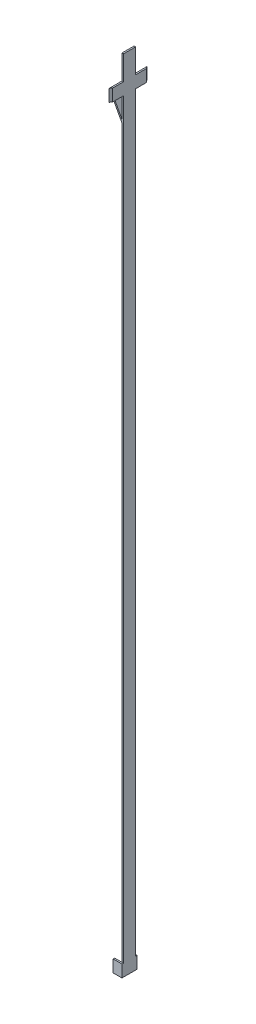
ISO-10303-21;
HEADER;
FILE_DESCRIPTION(('STEP AP214'),'2;1');
FILE_NAME('part.step','',(''),(''),'','','');
FILE_SCHEMA(('AUTOMOTIVE_DESIGN { 1 0 10303 214 1 1 1 1 }'));
ENDSEC;
DATA;
#1=APPLICATION_CONTEXT('core data for automotive mechanical design processes');
#2=APPLICATION_PROTOCOL_DEFINITION('international standard','automotive_design',2000,#1);
#3=PRODUCT_CONTEXT('',#1,'mechanical');
#4=PRODUCT('Part','Part','',(#3));
#5=PRODUCT_RELATED_PRODUCT_CATEGORY('part','',(#4));
#6=PRODUCT_DEFINITION_FORMATION('','',#4);
#7=PRODUCT_DEFINITION_CONTEXT('part definition',#1,'design');
#8=PRODUCT_DEFINITION('design','',#6,#7);
#9=PRODUCT_DEFINITION_SHAPE('','',#8);
#10=(LENGTH_UNIT() NAMED_UNIT(*) SI_UNIT(.MILLI.,.METRE.));
#11=(NAMED_UNIT(*) PLANE_ANGLE_UNIT() SI_UNIT($,.RADIAN.));
#12=(NAMED_UNIT(*) SI_UNIT($,.STERADIAN.) SOLID_ANGLE_UNIT());
#13=UNCERTAINTY_MEASURE_WITH_UNIT(LENGTH_MEASURE(1.E-05),#10,'distance_accuracy_value','');
#14=(GEOMETRIC_REPRESENTATION_CONTEXT(3) GLOBAL_UNCERTAINTY_ASSIGNED_CONTEXT((#13)) GLOBAL_UNIT_ASSIGNED_CONTEXT((#10,
#11,#12)) REPRESENTATION_CONTEXT('',''));
#15=CARTESIAN_POINT('',(0.,0.,0.));
#16=DIRECTION('',(0.,0.,1.));
#17=DIRECTION('',(1.,0.,0.));
#18=AXIS2_PLACEMENT_3D('',#15,#16,#17);
#19=CARTESIAN_POINT('',(0.,-9.99999999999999,10.61));
#20=DIRECTION('',(0.,-1.,0.));
#21=DIRECTION('',(0.,0.,-1.));
#22=AXIS2_PLACEMENT_3D('',#19,#20,#21);
#23=PLANE('',#22);
#24=CARTESIAN_POINT('',(-9.17,-10.,0.));
#25=DIRECTION('',(0.,-1.,0.));
#26=DIRECTION('',(0.,0.,-1.));
#27=AXIS2_PLACEMENT_3D('',#24,#25,#26);
#28=CIRCLE('',#27,12.);
#29=CARTESIAN_POINT('',(0.,-10.,-7.74022609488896));
#30=VERTEX_POINT('',#29);
#31=CARTESIAN_POINT('',(0.609999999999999,-10.,-6.95353147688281));
#32=VERTEX_POINT('',#31);
#33=EDGE_CURVE('E65',#30,#32,#28,.T.);
#34=ORIENTED_EDGE('',*,*,#33,.F.);
#35=DIRECTION('',(0.,0.,-1.));
#36=VECTOR('',#35,1.);
#37=CARTESIAN_POINT('',(0.,-9.99999999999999,10.61));
#38=LINE('',#37,#36);
#39=CARTESIAN_POINT('',(0.,-9.99999999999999,-2.5));
#40=VERTEX_POINT('',#39);
#41=EDGE_CURVE('E216',#40,#30,#38,.T.);
#42=ORIENTED_EDGE('',*,*,#41,.F.);
#43=DIRECTION('',(1.,0.,0.));
#44=VECTOR('',#43,1.);
#45=CARTESIAN_POINT('',(0.,-9.99999999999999,-2.5));
#46=LINE('',#45,#44);
#47=CARTESIAN_POINT('',(0.61,-9.99999999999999,-2.5));
#48=VERTEX_POINT('',#47);
#49=EDGE_CURVE('E379',#40,#48,#46,.T.);
#50=ORIENTED_EDGE('',*,*,#49,.T.);
#51=DIRECTION('',(0.,0.,-1.));
#52=VECTOR('',#51,1.);
#53=CARTESIAN_POINT('',(0.61,-9.99999999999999,10.61));
#54=LINE('',#53,#52);
#55=EDGE_CURVE('E215',#48,#32,#54,.T.);
#56=ORIENTED_EDGE('',*,*,#55,.T.);
#57=EDGE_LOOP('',(#34,#42,#50,#56));
#58=FACE_BOUND('',#57,.T.);
#59=ADVANCED_FACE('F43',(#58),#23,.F.);
#60=CARTESIAN_POINT('',(0.,-15.,10.61));
#61=DIRECTION('',(0.,1.,0.));
#62=DIRECTION('',(0.,0.,1.));
#63=AXIS2_PLACEMENT_3D('',#60,#61,#62);
#64=PLANE('',#63);
#65=CARTESIAN_POINT('',(-9.17,-15.,0.));
#66=DIRECTION('',(0.,1.,0.));
#67=DIRECTION('',(0.,0.,1.));
#68=AXIS2_PLACEMENT_3D('',#65,#66,#67);
#69=CIRCLE('',#68,12.);
#70=CARTESIAN_POINT('',(0.609999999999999,-15.,-6.95353147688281));
#71=VERTEX_POINT('',#70);
#72=CARTESIAN_POINT('',(0.,-15.,-7.74022609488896));
#73=VERTEX_POINT('',#72);
#74=EDGE_CURVE('E236',#71,#73,#69,.T.);
#75=ORIENTED_EDGE('',*,*,#74,.F.);
#76=DIRECTION('',(0.,0.,-1.));
#77=VECTOR('',#76,1.);
#78=CARTESIAN_POINT('',(0.61,-15.,10.61));
#79=LINE('',#78,#77);
#80=CARTESIAN_POINT('',(0.610000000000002,-15.,-2.5));
#81=VERTEX_POINT('',#80);
#82=EDGE_CURVE('E246',#81,#71,#79,.T.);
#83=ORIENTED_EDGE('',*,*,#82,.F.);
#84=DIRECTION('',(-1.,0.,0.));
#85=VECTOR('',#84,1.);
#86=CARTESIAN_POINT('',(0.,-15.,-2.5));
#87=LINE('',#86,#85);
#88=CARTESIAN_POINT('',(0.,-15.,-2.5));
#89=VERTEX_POINT('',#88);
#90=EDGE_CURVE('E51',#81,#89,#87,.T.);
#91=ORIENTED_EDGE('',*,*,#90,.T.);
#92=DIRECTION('',(0.,0.,-1.));
#93=VECTOR('',#92,1.);
#94=CARTESIAN_POINT('',(0.,-15.,10.61));
#95=LINE('',#94,#93);
#96=EDGE_CURVE('E249',#89,#73,#95,.T.);
#97=ORIENTED_EDGE('',*,*,#96,.T.);
#98=EDGE_LOOP('',(#75,#83,#91,#97));
#99=FACE_BOUND('',#98,.T.);
#100=ADVANCED_FACE('F389',(#99),#64,.F.);
#101=CARTESIAN_POINT('',(-9.17,-15.,0.));
#102=DIRECTION('',(0.,1.,0.));
#103=DIRECTION('',(0.,0.,1.));
#104=AXIS2_PLACEMENT_3D('',#101,#102,#103);
#105=CIRCLE('',#104,12.);
#106=CARTESIAN_POINT('',(0.,-15.,7.74022609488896));
#107=VERTEX_POINT('',#106);
#108=CARTESIAN_POINT('',(0.609999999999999,-15.,6.95353147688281));
#109=VERTEX_POINT('',#108);
#110=EDGE_CURVE('E227',#107,#109,#105,.T.);
#111=ORIENTED_EDGE('',*,*,#110,.F.);
#112=CARTESIAN_POINT('',(0.,-15.,2.5));
#113=VERTEX_POINT('',#112);
#114=EDGE_CURVE('E224',#107,#113,#95,.T.);
#115=ORIENTED_EDGE('',*,*,#114,.T.);
#116=DIRECTION('',(-1.,0.,0.));
#117=VECTOR('',#116,1.);
#118=CARTESIAN_POINT('',(0.,-15.,2.5));
#119=LINE('',#118,#117);
#120=CARTESIAN_POINT('',(0.61,-15.,2.5));
#121=VERTEX_POINT('',#120);
#122=EDGE_CURVE('E252',#121,#113,#119,.T.);
#123=ORIENTED_EDGE('',*,*,#122,.F.);
#124=EDGE_CURVE('E247',#109,#121,#79,.T.);
#125=ORIENTED_EDGE('',*,*,#124,.F.);
#126=EDGE_LOOP('',(#111,#115,#123,#125));
#127=FACE_BOUND('',#126,.T.);
#128=ADVANCED_FACE('F468',(#127),#64,.F.);
#129=CARTESIAN_POINT('',(-9.17,-10.,0.));
#130=DIRECTION('',(0.,-1.,0.));
#131=DIRECTION('',(0.,0.,-1.));
#132=AXIS2_PLACEMENT_3D('',#129,#130,#131);
#133=CIRCLE('',#132,12.);
#134=CARTESIAN_POINT('',(0.609999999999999,-10.,6.95353147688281));
#135=VERTEX_POINT('',#134);
#136=CARTESIAN_POINT('',(0.,-10.,7.74022609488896));
#137=VERTEX_POINT('',#136);
#138=EDGE_CURVE('E11',#135,#137,#133,.T.);
#139=ORIENTED_EDGE('',*,*,#138,.F.);
#140=CARTESIAN_POINT('',(0.610000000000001,-9.99999999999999,2.5));
#141=VERTEX_POINT('',#140);
#142=EDGE_CURVE('E244',#135,#141,#54,.T.);
#143=ORIENTED_EDGE('',*,*,#142,.T.);
#144=DIRECTION('',(1.,0.,0.));
#145=VECTOR('',#144,1.);
#146=CARTESIAN_POINT('',(0.,-9.99999999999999,2.5));
#147=LINE('',#146,#145);
#148=CARTESIAN_POINT('',(0.,-9.99999999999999,2.5));
#149=VERTEX_POINT('',#148);
#150=EDGE_CURVE('E211',#149,#141,#147,.T.);
#151=ORIENTED_EDGE('',*,*,#150,.F.);
#152=EDGE_CURVE('E206',#137,#149,#38,.T.);
#153=ORIENTED_EDGE('',*,*,#152,.F.);
#154=EDGE_LOOP('',(#139,#143,#151,#153));
#155=FACE_BOUND('',#154,.T.);
#156=ADVANCED_FACE('F208',(#155),#23,.F.);
#157=CARTESIAN_POINT('',(0.,0.,2.5));
#158=DIRECTION('',(0.,0.,1.));
#159=DIRECTION('',(1.,0.,0.));
#160=AXIS2_PLACEMENT_3D('',#157,#158,#159);
#161=PLANE('',#160);
#162=DIRECTION('',(-0.984807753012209,-0.173648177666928,0.));
#163=VECTOR('',#162,1.);
#164=CARTESIAN_POINT('',(2.6710764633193,-15.1484273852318,2.5));
#165=LINE('',#164,#163);
#166=CARTESIAN_POINT('',(0.,-15.6194102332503,2.5));
#167=VERTEX_POINT('',#166);
#168=CARTESIAN_POINT('',(-3.98617976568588,-16.3222812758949,2.5));
#169=VERTEX_POINT('',#168);
#170=EDGE_CURVE('E317',#167,#169,#165,.T.);
#171=ORIENTED_EDGE('',*,*,#170,.F.);
#172=DIRECTION('',(0.,-1.,0.));
#173=VECTOR('',#172,1.);
#174=CARTESIAN_POINT('',(0.,0.,2.5));
#175=LINE('',#174,#173);
#176=CARTESIAN_POINT('',(0.,-23.7147562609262,2.5));
#177=VERTEX_POINT('',#176);
#178=EDGE_CURVE('E320',#167,#177,#175,.T.);
#179=ORIENTED_EDGE('',*,*,#178,.T.);
#180=DIRECTION('',(0.474618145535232,-0.880191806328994,0.));
#181=VECTOR('',#180,1.);
#182=CARTESIAN_POINT('',(-9.90695806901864,-5.34204253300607,2.5));
#183=LINE('',#182,#181);
#184=EDGE_CURVE('E323',#169,#177,#183,.T.);
#185=ORIENTED_EDGE('',*,*,#184,.F.);
#186=EDGE_LOOP('',(#171,#179,#185));
#187=FACE_BOUND('',#186,.T.);
#188=DIRECTION('',(0.,-1.,0.));
#189=VECTOR('',#188,1.);
#190=CARTESIAN_POINT('',(0.61,0.,2.5));
#191=LINE('',#190,#189);
#192=CARTESIAN_POINT('',(0.61000000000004,-325.,2.5));
#193=VERTEX_POINT('',#192);
#194=EDGE_CURVE('E335',#121,#193,#191,.T.);
#195=ORIENTED_EDGE('',*,*,#194,.F.);
#196=ORIENTED_EDGE('',*,*,#122,.T.);
#197=DIRECTION('',(-0.984807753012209,-0.173648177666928,0.));
#198=VECTOR('',#197,1.);
#199=CARTESIAN_POINT('',(2.56515107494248,-14.5476946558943,2.5));
#200=LINE('',#199,#198);
#201=CARTESIAN_POINT('',(-4.92403876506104,-15.8682408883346,2.5));
#202=VERTEX_POINT('',#201);
#203=EDGE_CURVE('E328',#113,#202,#200,.T.);
#204=ORIENTED_EDGE('',*,*,#203,.T.);
#205=DIRECTION('',(0.474618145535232,-0.880191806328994,0.));
#206=VECTOR('',#205,1.);
#207=CARTESIAN_POINT('',(-10.4438750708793,-5.63155960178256,2.5));
#208=LINE('',#207,#206);
#209=CARTESIAN_POINT('',(0.,-25.,2.5));
#210=VERTEX_POINT('',#209);
#211=EDGE_CURVE('E330',#202,#210,#208,.T.);
#212=ORIENTED_EDGE('',*,*,#211,.T.);
#213=CARTESIAN_POINT('',(0.,-325.,2.5));
#214=VERTEX_POINT('',#213);
#215=EDGE_CURVE('E324',#210,#214,#175,.T.);
#216=ORIENTED_EDGE('',*,*,#215,.T.);
#217=DIRECTION('',(1.,0.,0.));
#218=VECTOR('',#217,1.);
#219=CARTESIAN_POINT('',(0.,-325.,2.5));
#220=LINE('',#219,#218);
#221=EDGE_CURVE('E332',#214,#193,#220,.T.);
#222=ORIENTED_EDGE('',*,*,#221,.T.);
#223=EDGE_LOOP('',(#195,#196,#204,#212,#216,#222));
#224=FACE_BOUND('',#223,.T.);
#225=ADVANCED_FACE('F438',(#187,#224),#161,.T.);
#226=CARTESIAN_POINT('',(0.,0.,2.5));
#227=VERTEX_POINT('',#226);
#228=EDGE_CURVE('E325',#227,#149,#175,.T.);
#229=ORIENTED_EDGE('',*,*,#228,.T.);
#230=ORIENTED_EDGE('',*,*,#150,.T.);
#231=CARTESIAN_POINT('',(0.61,0.,2.5));
#232=VERTEX_POINT('',#231);
#233=EDGE_CURVE('E336',#232,#141,#191,.T.);
#234=ORIENTED_EDGE('',*,*,#233,.F.);
#235=DIRECTION('',(1.,0.,0.));
#236=VECTOR('',#235,1.);
#237=CARTESIAN_POINT('',(0.,0.,2.5));
#238=LINE('',#237,#236);
#239=EDGE_CURVE('E339',#227,#232,#238,.T.);
#240=ORIENTED_EDGE('',*,*,#239,.F.);
#241=EDGE_LOOP('',(#229,#230,#234,#240));
#242=FACE_BOUND('',#241,.T.);
#243=ADVANCED_FACE('F433',(#242),#161,.T.);
#244=CARTESIAN_POINT('',(0.,0.,-2.5));
#245=DIRECTION('',(0.,0.,1.));
#246=DIRECTION('',(1.,0.,0.));
#247=AXIS2_PLACEMENT_3D('',#244,#245,#246);
#248=PLANE('',#247);
#249=DIRECTION('',(-0.984807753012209,-0.173648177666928,0.));
#250=VECTOR('',#249,1.);
#251=CARTESIAN_POINT('',(2.6710764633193,-15.1484273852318,-2.5));
#252=LINE('',#251,#250);
#253=CARTESIAN_POINT('',(0.,-15.6194102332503,-2.5));
#254=VERTEX_POINT('',#253);
#255=CARTESIAN_POINT('',(-3.98617976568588,-16.3222812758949,-2.5));
#256=VERTEX_POINT('',#255);
#257=EDGE_CURVE('E316',#254,#256,#252,.T.);
#258=ORIENTED_EDGE('',*,*,#257,.T.);
#259=DIRECTION('',(0.474618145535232,-0.880191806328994,0.));
#260=VECTOR('',#259,1.);
#261=CARTESIAN_POINT('',(-9.90695806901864,-5.34204253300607,-2.5));
#262=LINE('',#261,#260);
#263=CARTESIAN_POINT('',(0.,-23.7147562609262,-2.5));
#264=VERTEX_POINT('',#263);
#265=EDGE_CURVE('E348',#256,#264,#262,.T.);
#266=ORIENTED_EDGE('',*,*,#265,.T.);
#267=DIRECTION('',(0.,-1.,0.));
#268=VECTOR('',#267,1.);
#269=CARTESIAN_POINT('',(0.,0.,-2.5));
#270=LINE('',#269,#268);
#271=EDGE_CURVE('E345',#254,#264,#270,.T.);
#272=ORIENTED_EDGE('',*,*,#271,.F.);
#273=EDGE_LOOP('',(#258,#266,#272));
#274=FACE_BOUND('',#273,.T.);
#275=ORIENTED_EDGE('',*,*,#90,.F.);
#276=DIRECTION('',(0.,-1.,0.));
#277=VECTOR('',#276,1.);
#278=CARTESIAN_POINT('',(0.61,0.,-2.5));
#279=LINE('',#278,#277);
#280=CARTESIAN_POINT('',(0.61000000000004,-325.,-2.5));
#281=VERTEX_POINT('',#280);
#282=EDGE_CURVE('E360',#81,#281,#279,.T.);
#283=ORIENTED_EDGE('',*,*,#282,.T.);
#284=DIRECTION('',(1.,0.,0.));
#285=VECTOR('',#284,1.);
#286=CARTESIAN_POINT('',(0.,-325.,-2.5));
#287=LINE('',#286,#285);
#288=CARTESIAN_POINT('',(0.,-325.,-2.5));
#289=VERTEX_POINT('',#288);
#290=EDGE_CURVE('E357',#289,#281,#287,.T.);
#291=ORIENTED_EDGE('',*,*,#290,.F.);
#292=CARTESIAN_POINT('',(0.,-25.,-2.5));
#293=VERTEX_POINT('',#292);
#294=EDGE_CURVE('E349',#293,#289,#270,.T.);
#295=ORIENTED_EDGE('',*,*,#294,.F.);
#296=DIRECTION('',(0.474618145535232,-0.880191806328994,0.));
#297=VECTOR('',#296,1.);
#298=CARTESIAN_POINT('',(-10.4438750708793,-5.63155960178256,-2.5));
#299=LINE('',#298,#297);
#300=CARTESIAN_POINT('',(-4.92403876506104,-15.8682408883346,-2.5));
#301=VERTEX_POINT('',#300);
#302=EDGE_CURVE('E355',#301,#293,#299,.T.);
#303=ORIENTED_EDGE('',*,*,#302,.F.);
#304=DIRECTION('',(-0.984807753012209,-0.173648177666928,0.));
#305=VECTOR('',#304,1.);
#306=CARTESIAN_POINT('',(2.56515107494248,-14.5476946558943,-2.5));
#307=LINE('',#306,#305);
#308=EDGE_CURVE('E353',#89,#301,#307,.T.);
#309=ORIENTED_EDGE('',*,*,#308,.F.);
#310=EDGE_LOOP('',(#275,#283,#291,#295,#303,#309));
#311=FACE_BOUND('',#310,.T.);
#312=ADVANCED_FACE('F399',(#274,#311),#248,.F.);
#313=ORIENTED_EDGE('',*,*,#49,.F.);
#314=CARTESIAN_POINT('',(0.,0.,-2.5));
#315=VERTEX_POINT('',#314);
#316=EDGE_CURVE('E350',#315,#40,#270,.T.);
#317=ORIENTED_EDGE('',*,*,#316,.F.);
#318=DIRECTION('',(1.,0.,0.));
#319=VECTOR('',#318,1.);
#320=CARTESIAN_POINT('',(0.,0.,-2.5));
#321=LINE('',#320,#319);
#322=CARTESIAN_POINT('',(0.61,0.,-2.5));
#323=VERTEX_POINT('',#322);
#324=EDGE_CURVE('E321',#315,#323,#321,.T.);
#325=ORIENTED_EDGE('',*,*,#324,.T.);
#326=EDGE_CURVE('E361',#323,#48,#279,.T.);
#327=ORIENTED_EDGE('',*,*,#326,.T.);
#328=EDGE_LOOP('',(#313,#317,#325,#327));
#329=FACE_BOUND('',#328,.T.);
#330=ADVANCED_FACE('F428',(#329),#248,.F.);
#331=CARTESIAN_POINT('',(0.,-325.,3.11));
#332=DIRECTION('',(0.,1.,0.));
#333=DIRECTION('',(0.,0.,1.));
#334=AXIS2_PLACEMENT_3D('',#331,#332,#333);
#335=PLANE('',#334);
#336=DIRECTION('',(1.,0.,0.));
#337=VECTOR('',#336,1.);
#338=CARTESIAN_POINT('',(0.,-325.,2.5));
#339=LINE('',#338,#337);
#340=CARTESIAN_POINT('',(-2.99999999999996,-325.,2.5));
#341=VERTEX_POINT('',#340);
#342=EDGE_CURVE('E263',#341,#214,#339,.T.);
#343=ORIENTED_EDGE('',*,*,#342,.F.);
#344=DIRECTION('',(0.,0.,-1.));
#345=VECTOR('',#344,1.);
#346=CARTESIAN_POINT('',(-2.99999999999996,-325.,3.11));
#347=LINE('',#346,#345);
#348=CARTESIAN_POINT('',(-2.99999999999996,-325.,3.11));
#349=VERTEX_POINT('',#348);
#350=EDGE_CURVE('E313',#349,#341,#347,.T.);
#351=ORIENTED_EDGE('',*,*,#350,.F.);
#352=DIRECTION('',(1.,0.,0.));
#353=VECTOR('',#352,1.);
#354=CARTESIAN_POINT('',(0.,-325.,3.11));
#355=LINE('',#354,#353);
#356=CARTESIAN_POINT('',(0.61000000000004,-325.,3.11));
#357=VERTEX_POINT('',#356);
#358=EDGE_CURVE('E279',#349,#357,#355,.T.);
#359=ORIENTED_EDGE('',*,*,#358,.T.);
#360=DIRECTION('',(0.,0.,-1.));
#361=VECTOR('',#360,1.);
#362=CARTESIAN_POINT('',(0.61000000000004,-325.,3.11));
#363=LINE('',#362,#361);
#364=EDGE_CURVE('E303',#357,#193,#363,.T.);
#365=ORIENTED_EDGE('',*,*,#364,.T.);
#366=ORIENTED_EDGE('',*,*,#221,.F.);
#367=EDGE_LOOP('',(#343,#351,#359,#365,#366));
#368=FACE_BOUND('',#367,.T.);
#369=ADVANCED_FACE('F442',(#368),#335,.T.);
#370=CARTESIAN_POINT('',(-2.99999999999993,0.,3.11));
#371=DIRECTION('',(-1.,0.,0.));
#372=DIRECTION('',(0.,-1.,0.));
#373=AXIS2_PLACEMENT_3D('',#370,#371,#372);
#374=PLANE('',#373);
#375=DIRECTION('',(0.,1.,0.));
#376=VECTOR('',#375,1.);
#377=CARTESIAN_POINT('',(-2.99999999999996,-330.001,2.5));
#378=LINE('',#377,#376);
#379=CARTESIAN_POINT('',(-2.99999999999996,-330.,2.5));
#380=VERTEX_POINT('',#379);
#381=EDGE_CURVE('E270',#380,#341,#378,.T.);
#382=ORIENTED_EDGE('',*,*,#381,.F.);
#383=DIRECTION('',(0.,0.,-1.));
#384=VECTOR('',#383,1.);
#385=CARTESIAN_POINT('',(-2.99999999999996,-330.,3.11));
#386=LINE('',#385,#384);
#387=CARTESIAN_POINT('',(-2.99999999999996,-330.,3.11));
#388=VERTEX_POINT('',#387);
#389=EDGE_CURVE('E309',#388,#380,#386,.T.);
#390=ORIENTED_EDGE('',*,*,#389,.F.);
#391=DIRECTION('',(0.,1.,0.));
#392=VECTOR('',#391,1.);
#393=CARTESIAN_POINT('',(-2.99999999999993,0.,3.11));
#394=LINE('',#393,#392);
#395=EDGE_CURVE('E282',#388,#349,#394,.T.);
#396=ORIENTED_EDGE('',*,*,#395,.T.);
#397=ORIENTED_EDGE('',*,*,#350,.T.);
#398=EDGE_LOOP('',(#382,#390,#396,#397));
#399=FACE_BOUND('',#398,.T.);
#400=ADVANCED_FACE('F500',(#399),#374,.T.);
#401=CARTESIAN_POINT('',(0.,0.,2.5));
#402=DIRECTION('',(1.,0.,0.));
#403=DIRECTION('',(0.,1.,0.));
#404=AXIS2_PLACEMENT_3D('',#401,#402,#403);
#405=PLANE('',#404);
#406=DIRECTION('',(0.,1.,0.));
#407=VECTOR('',#406,1.);
#408=CARTESIAN_POINT('',(0.,-330.,-7.74022609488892));
#409=LINE('',#408,#407);
#410=EDGE_CURVE('E240',#73,#30,#409,.T.);
#411=ORIENTED_EDGE('',*,*,#410,.F.);
#412=ORIENTED_EDGE('',*,*,#96,.F.);
#413=DIRECTION('',(0.,0.,-1.));
#414=VECTOR('',#413,1.);
#415=CARTESIAN_POINT('',(0.,-15.,2.5));
#416=LINE('',#415,#414);
#417=EDGE_CURVE('E376',#113,#89,#416,.T.);
#418=ORIENTED_EDGE('',*,*,#417,.F.);
#419=ORIENTED_EDGE('',*,*,#114,.F.);
#420=DIRECTION('',(0.,1.,0.));
#421=VECTOR('',#420,1.);
#422=CARTESIAN_POINT('',(0.,-330.,7.74022609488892));
#423=LINE('',#422,#421);
#424=EDGE_CURVE('E220',#137,#107,#423,.F.);
#425=ORIENTED_EDGE('',*,*,#424,.F.);
#426=ORIENTED_EDGE('',*,*,#152,.T.);
#427=ORIENTED_EDGE('',*,*,#228,.F.);
#428=DIRECTION('',(0.,0.,-1.));
#429=VECTOR('',#428,1.);
#430=CARTESIAN_POINT('',(0.,0.,2.5));
#431=LINE('',#430,#429);
#432=EDGE_CURVE('E365',#227,#315,#431,.T.);
#433=ORIENTED_EDGE('',*,*,#432,.T.);
#434=ORIENTED_EDGE('',*,*,#316,.T.);
#435=ORIENTED_EDGE('',*,*,#41,.T.);
#436=EDGE_LOOP('',(#411,#412,#418,#419,#425,#426,#427,#433,#434,#435));
#437=FACE_BOUND('',#436,.T.);
#438=ADVANCED_FACE('F222',(#437),#405,.F.);
#439=CARTESIAN_POINT('',(2.56515107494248,-14.5476946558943,2.5));
#440=DIRECTION('',(0.173648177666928,-0.984807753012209,0.));
#441=DIRECTION('',(0.984807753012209,0.173648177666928,0.));
#442=AXIS2_PLACEMENT_3D('',#439,#440,#441);
#443=PLANE('',#442);
#444=ORIENTED_EDGE('',*,*,#308,.T.);
#445=DIRECTION('',(0.,0.,-1.));
#446=VECTOR('',#445,1.);
#447=CARTESIAN_POINT('',(-4.92403876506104,-15.8682408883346,2.5));
#448=LINE('',#447,#446);
#449=EDGE_CURVE('E373',#202,#301,#448,.T.);
#450=ORIENTED_EDGE('',*,*,#449,.F.);
#451=ORIENTED_EDGE('',*,*,#203,.F.);
#452=ORIENTED_EDGE('',*,*,#417,.T.);
#453=EDGE_LOOP('',(#444,#450,#451,#452));
#454=FACE_BOUND('',#453,.T.);
#455=ADVANCED_FACE('F450',(#454),#443,.F.);
#456=CARTESIAN_POINT('',(-10.4438750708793,-5.63155960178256,2.5));
#457=DIRECTION('',(0.880191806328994,0.474618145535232,0.));
#458=DIRECTION('',(-0.474618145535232,0.880191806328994,0.));
#459=AXIS2_PLACEMENT_3D('',#456,#457,#458);
#460=PLANE('',#459);
#461=ORIENTED_EDGE('',*,*,#302,.T.);
#462=DIRECTION('',(0.,0.,-1.));
#463=VECTOR('',#462,1.);
#464=CARTESIAN_POINT('',(0.,-25.,2.5));
#465=LINE('',#464,#463);
#466=EDGE_CURVE('E370',#210,#293,#465,.T.);
#467=ORIENTED_EDGE('',*,*,#466,.F.);
#468=ORIENTED_EDGE('',*,*,#211,.F.);
#469=ORIENTED_EDGE('',*,*,#449,.T.);
#470=EDGE_LOOP('',(#461,#467,#468,#469));
#471=FACE_BOUND('',#470,.T.);
#472=ADVANCED_FACE('F452',(#471),#460,.F.);
#473=ORIENTED_EDGE('',*,*,#294,.T.);
#474=DIRECTION('',(0.,1.,0.));
#475=VECTOR('',#474,1.);
#476=CARTESIAN_POINT('',(0.,-330.001,-2.5));
#477=LINE('',#476,#475);
#478=CARTESIAN_POINT('',(0.,-330.,-2.5));
#479=VERTEX_POINT('',#478);
#480=EDGE_CURVE('E266',#479,#289,#477,.T.);
#481=ORIENTED_EDGE('',*,*,#480,.F.);
#482=DIRECTION('',(0.,0.,-1.));
#483=VECTOR('',#482,1.);
#484=CARTESIAN_POINT('',(0.,-330.,-2.5));
#485=LINE('',#484,#483);
#486=CARTESIAN_POINT('',(0.,-330.,2.5));
#487=VERTEX_POINT('',#486);
#488=EDGE_CURVE('E255',#487,#479,#485,.T.);
#489=ORIENTED_EDGE('',*,*,#488,.F.);
#490=DIRECTION('',(0.,1.,0.));
#491=VECTOR('',#490,1.);
#492=CARTESIAN_POINT('',(0.,-330.001,2.5));
#493=LINE('',#492,#491);
#494=EDGE_CURVE('E267',#487,#214,#493,.T.);
#495=ORIENTED_EDGE('',*,*,#494,.T.);
#496=ORIENTED_EDGE('',*,*,#215,.F.);
#497=ORIENTED_EDGE('',*,*,#466,.T.);
#498=EDGE_LOOP('',(#473,#481,#489,#495,#496,#497));
#499=FACE_BOUND('',#498,.T.);
#500=ADVANCED_FACE('F418',(#499),#405,.F.);
#501=CARTESIAN_POINT('',(0.61,0.,2.5));
#502=DIRECTION('',(1.,0.,0.));
#503=DIRECTION('',(0.,1.,0.));
#504=AXIS2_PLACEMENT_3D('',#501,#502,#503);
#505=PLANE('',#504);
#506=ORIENTED_EDGE('',*,*,#82,.T.);
#507=DIRECTION('',(0.,1.,0.));
#508=VECTOR('',#507,1.);
#509=CARTESIAN_POINT('',(0.610000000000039,-330.,-6.95353147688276));
#510=LINE('',#509,#508);
#511=EDGE_CURVE('E58',#71,#32,#510,.T.);
#512=ORIENTED_EDGE('',*,*,#511,.T.);
#513=ORIENTED_EDGE('',*,*,#55,.F.);
#514=ORIENTED_EDGE('',*,*,#326,.F.);
#515=DIRECTION('',(0.,0.,-1.));
#516=VECTOR('',#515,1.);
#517=CARTESIAN_POINT('',(0.61,0.,2.5));
#518=LINE('',#517,#516);
#519=EDGE_CURVE('E367',#232,#323,#518,.T.);
#520=ORIENTED_EDGE('',*,*,#519,.F.);
#521=ORIENTED_EDGE('',*,*,#233,.T.);
#522=ORIENTED_EDGE('',*,*,#142,.F.);
#523=DIRECTION('',(0.,1.,0.));
#524=VECTOR('',#523,1.);
#525=CARTESIAN_POINT('',(0.610000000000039,-330.,6.95353147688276));
#526=LINE('',#525,#524);
#527=EDGE_CURVE('E228',#135,#109,#526,.F.);
#528=ORIENTED_EDGE('',*,*,#527,.T.);
#529=ORIENTED_EDGE('',*,*,#124,.T.);
#530=ORIENTED_EDGE('',*,*,#194,.T.);
#531=ORIENTED_EDGE('',*,*,#364,.F.);
#532=DIRECTION('',(0.,-1.,0.));
#533=VECTOR('',#532,1.);
#534=CARTESIAN_POINT('',(0.61,0.,3.11));
#535=LINE('',#534,#533);
#536=CARTESIAN_POINT('',(0.61000000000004,-330.,3.11));
#537=VERTEX_POINT('',#536);
#538=EDGE_CURVE('E289',#357,#537,#535,.T.);
#539=ORIENTED_EDGE('',*,*,#538,.T.);
#540=DIRECTION('',(0.,0.,-1.));
#541=VECTOR('',#540,1.);
#542=CARTESIAN_POINT('',(0.61000000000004,-330.,3.11));
#543=LINE('',#542,#541);
#544=CARTESIAN_POINT('',(0.61000000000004,-330.,-3.11));
#545=VERTEX_POINT('',#544);
#546=EDGE_CURVE('E306',#537,#545,#543,.T.);
#547=ORIENTED_EDGE('',*,*,#546,.T.);
#548=DIRECTION('',(0.,-1.,0.));
#549=VECTOR('',#548,1.);
#550=CARTESIAN_POINT('',(0.61,0.,-3.11));
#551=LINE('',#550,#549);
#552=CARTESIAN_POINT('',(0.61000000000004,-325.,-3.11));
#553=VERTEX_POINT('',#552);
#554=EDGE_CURVE('E283',#553,#545,#551,.T.);
#555=ORIENTED_EDGE('',*,*,#554,.F.);
#556=EDGE_CURVE('E292',#281,#553,#363,.T.);
#557=ORIENTED_EDGE('',*,*,#556,.F.);
#558=ORIENTED_EDGE('',*,*,#282,.F.);
#559=EDGE_LOOP('',(#506,#512,#513,#514,#520,#521,#522,#528,#529,#530,#531,#539,#547,#555,#557,#558));
#560=FACE_BOUND('',#559,.T.);
#561=ADVANCED_FACE('F395',(#560),#505,.T.);
#562=CARTESIAN_POINT('',(2.6710764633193,-15.1484273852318,2.5));
#563=DIRECTION('',(0.173648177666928,-0.984807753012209,0.));
#564=DIRECTION('',(0.984807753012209,0.173648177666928,0.));
#565=AXIS2_PLACEMENT_3D('',#562,#563,#564);
#566=PLANE('',#565);
#567=ORIENTED_EDGE('',*,*,#257,.F.);
#568=DIRECTION('',(0.,0.,-1.));
#569=VECTOR('',#568,1.);
#570=CARTESIAN_POINT('',(0.,-15.6194102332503,2.5));
#571=LINE('',#570,#569);
#572=EDGE_CURVE('E368',#167,#254,#571,.T.);
#573=ORIENTED_EDGE('',*,*,#572,.F.);
#574=ORIENTED_EDGE('',*,*,#170,.T.);
#575=DIRECTION('',(0.,0.,-1.));
#576=VECTOR('',#575,1.);
#577=CARTESIAN_POINT('',(-3.98617976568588,-16.3222812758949,2.5));
#578=LINE('',#577,#576);
#579=EDGE_CURVE('E342',#169,#256,#578,.T.);
#580=ORIENTED_EDGE('',*,*,#579,.T.);
#581=EDGE_LOOP('',(#567,#573,#574,#580));
#582=FACE_BOUND('',#581,.T.);
#583=ADVANCED_FACE('F45',(#582),#566,.T.);
#584=ORIENTED_EDGE('',*,*,#271,.T.);
#585=DIRECTION('',(0.,0.,-1.));
#586=VECTOR('',#585,1.);
#587=CARTESIAN_POINT('',(0.,-23.7147562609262,2.5));
#588=LINE('',#587,#586);
#589=EDGE_CURVE('E381',#177,#264,#588,.T.);
#590=ORIENTED_EDGE('',*,*,#589,.F.);
#591=ORIENTED_EDGE('',*,*,#178,.F.);
#592=ORIENTED_EDGE('',*,*,#572,.T.);
#593=EDGE_LOOP('',(#584,#590,#591,#592));
#594=FACE_BOUND('',#593,.T.);
#595=ADVANCED_FACE('F460',(#594),#405,.F.);
#596=CARTESIAN_POINT('',(-9.90695806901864,-5.34204253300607,2.5));
#597=DIRECTION('',(0.880191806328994,0.474618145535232,0.));
#598=DIRECTION('',(-0.474618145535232,0.880191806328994,0.));
#599=AXIS2_PLACEMENT_3D('',#596,#597,#598);
#600=PLANE('',#599);
#601=ORIENTED_EDGE('',*,*,#265,.F.);
#602=ORIENTED_EDGE('',*,*,#579,.F.);
#603=ORIENTED_EDGE('',*,*,#184,.T.);
#604=ORIENTED_EDGE('',*,*,#589,.T.);
#605=EDGE_LOOP('',(#601,#602,#603,#604));
#606=FACE_BOUND('',#605,.T.);
#607=ADVANCED_FACE('F508',(#606),#600,.T.);
#608=CARTESIAN_POINT('',(0.,0.,2.5));
#609=DIRECTION('',(0.,1.,0.));
#610=DIRECTION('',(0.,0.,1.));
#611=AXIS2_PLACEMENT_3D('',#608,#609,#610);
#612=PLANE('',#611);
#613=ORIENTED_EDGE('',*,*,#324,.F.);
#614=ORIENTED_EDGE('',*,*,#432,.F.);
#615=ORIENTED_EDGE('',*,*,#239,.T.);
#616=ORIENTED_EDGE('',*,*,#519,.T.);
#617=EDGE_LOOP('',(#613,#614,#615,#616));
#618=FACE_BOUND('',#617,.T.);
#619=ADVANCED_FACE('F430',(#618),#612,.T.);
#620=DIRECTION('',(-1.,0.,0.));
#621=VECTOR('',#620,1.);
#622=CARTESIAN_POINT('',(0.,-325.,-2.5));
#623=LINE('',#622,#621);
#624=CARTESIAN_POINT('',(-2.99999999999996,-325.,-2.5));
#625=VERTEX_POINT('',#624);
#626=EDGE_CURVE('E261',#289,#625,#623,.T.);
#627=ORIENTED_EDGE('',*,*,#626,.F.);
#628=ORIENTED_EDGE('',*,*,#290,.T.);
#629=ORIENTED_EDGE('',*,*,#556,.T.);
#630=DIRECTION('',(1.,0.,0.));
#631=VECTOR('',#630,1.);
#632=CARTESIAN_POINT('',(0.,-325.,-3.11));
#633=LINE('',#632,#631);
#634=CARTESIAN_POINT('',(-2.99999999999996,-325.,-3.11));
#635=VERTEX_POINT('',#634);
#636=EDGE_CURVE('E278',#635,#553,#633,.T.);
#637=ORIENTED_EDGE('',*,*,#636,.F.);
#638=EDGE_CURVE('E312',#625,#635,#347,.T.);
#639=ORIENTED_EDGE('',*,*,#638,.F.);
#640=EDGE_LOOP('',(#627,#628,#629,#637,#639));
#641=FACE_BOUND('',#640,.T.);
#642=ADVANCED_FACE('F404',(#641),#335,.T.);
#643=DIRECTION('',(0.,1.,0.));
#644=VECTOR('',#643,1.);
#645=CARTESIAN_POINT('',(-2.99999999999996,-330.001,-2.5));
#646=LINE('',#645,#644);
#647=CARTESIAN_POINT('',(-2.99999999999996,-330.,-2.5));
#648=VERTEX_POINT('',#647);
#649=EDGE_CURVE('E272',#648,#625,#646,.T.);
#650=ORIENTED_EDGE('',*,*,#649,.T.);
#651=ORIENTED_EDGE('',*,*,#638,.T.);
#652=DIRECTION('',(0.,1.,0.));
#653=VECTOR('',#652,1.);
#654=CARTESIAN_POINT('',(-2.99999999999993,0.,-3.11));
#655=LINE('',#654,#653);
#656=CARTESIAN_POINT('',(-2.99999999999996,-330.,-3.11));
#657=VERTEX_POINT('',#656);
#658=EDGE_CURVE('E295',#657,#635,#655,.T.);
#659=ORIENTED_EDGE('',*,*,#658,.F.);
#660=EDGE_CURVE('E308',#648,#657,#386,.T.);
#661=ORIENTED_EDGE('',*,*,#660,.F.);
#662=EDGE_LOOP('',(#650,#651,#659,#661));
#663=FACE_BOUND('',#662,.T.);
#664=ADVANCED_FACE('F412',(#663),#374,.T.);
#665=CARTESIAN_POINT('',(0.,-330.,3.11));
#666=DIRECTION('',(0.,-1.,0.));
#667=DIRECTION('',(0.,0.,-1.));
#668=AXIS2_PLACEMENT_3D('',#665,#666,#667);
#669=PLANE('',#668);
#670=DIRECTION('',(1.,0.,0.));
#671=VECTOR('',#670,1.);
#672=CARTESIAN_POINT('',(0.,-330.,2.5));
#673=LINE('',#672,#671);
#674=EDGE_CURVE('E258',#380,#487,#673,.T.);
#675=ORIENTED_EDGE('',*,*,#674,.T.);
#676=ORIENTED_EDGE('',*,*,#488,.T.);
#677=DIRECTION('',(-1.,0.,0.));
#678=VECTOR('',#677,1.);
#679=CARTESIAN_POINT('',(0.,-330.,-2.5));
#680=LINE('',#679,#678);
#681=EDGE_CURVE('E269',#479,#648,#680,.T.);
#682=ORIENTED_EDGE('',*,*,#681,.T.);
#683=ORIENTED_EDGE('',*,*,#660,.T.);
#684=DIRECTION('',(-1.,0.,0.));
#685=VECTOR('',#684,1.);
#686=CARTESIAN_POINT('',(0.,-330.,-3.11));
#687=LINE('',#686,#685);
#688=EDGE_CURVE('E298',#545,#657,#687,.T.);
#689=ORIENTED_EDGE('',*,*,#688,.F.);
#690=ORIENTED_EDGE('',*,*,#546,.F.);
#691=DIRECTION('',(-1.,0.,0.));
#692=VECTOR('',#691,1.);
#693=CARTESIAN_POINT('',(0.,-330.,3.11));
#694=LINE('',#693,#692);
#695=EDGE_CURVE('E286',#537,#388,#694,.T.);
#696=ORIENTED_EDGE('',*,*,#695,.T.);
#697=ORIENTED_EDGE('',*,*,#389,.T.);
#698=EDGE_LOOP('',(#675,#676,#682,#683,#689,#690,#696,#697));
#699=FACE_BOUND('',#698,.T.);
#700=ADVANCED_FACE('F416',(#699),#669,.T.);
#701=CARTESIAN_POINT('',(0.,0.,3.11));
#702=DIRECTION('',(0.,0.,1.));
#703=DIRECTION('',(1.,0.,0.));
#704=AXIS2_PLACEMENT_3D('',#701,#702,#703);
#705=PLANE('',#704);
#706=ORIENTED_EDGE('',*,*,#358,.F.);
#707=ORIENTED_EDGE('',*,*,#395,.F.);
#708=ORIENTED_EDGE('',*,*,#695,.F.);
#709=ORIENTED_EDGE('',*,*,#538,.F.);
#710=EDGE_LOOP('',(#706,#707,#708,#709));
#711=FACE_BOUND('',#710,.T.);
#712=ADVANCED_FACE('F489',(#711),#705,.T.);
#713=CARTESIAN_POINT('',(0.,0.,-3.11));
#714=DIRECTION('',(0.,0.,1.));
#715=DIRECTION('',(1.,0.,0.));
#716=AXIS2_PLACEMENT_3D('',#713,#714,#715);
#717=PLANE('',#716);
#718=ORIENTED_EDGE('',*,*,#636,.T.);
#719=ORIENTED_EDGE('',*,*,#554,.T.);
#720=ORIENTED_EDGE('',*,*,#688,.T.);
#721=ORIENTED_EDGE('',*,*,#658,.T.);
#722=EDGE_LOOP('',(#718,#719,#720,#721));
#723=FACE_BOUND('',#722,.T.);
#724=ADVANCED_FACE('F485',(#723),#717,.F.);
#725=CARTESIAN_POINT('',(0.,-330.001,2.5));
#726=DIRECTION('',(0.,0.,1.));
#727=DIRECTION('',(1.,0.,0.));
#728=AXIS2_PLACEMENT_3D('',#725,#726,#727);
#729=PLANE('',#728);
#730=ORIENTED_EDGE('',*,*,#381,.T.);
#731=ORIENTED_EDGE('',*,*,#342,.T.);
#732=ORIENTED_EDGE('',*,*,#494,.F.);
#733=ORIENTED_EDGE('',*,*,#674,.F.);
#734=EDGE_LOOP('',(#730,#731,#732,#733));
#735=FACE_BOUND('',#734,.T.);
#736=ADVANCED_FACE('F482',(#735),#729,.F.);
#737=CARTESIAN_POINT('',(0.,-330.001,-2.5));
#738=DIRECTION('',(0.,0.,-1.));
#739=DIRECTION('',(-1.,0.,0.));
#740=AXIS2_PLACEMENT_3D('',#737,#738,#739);
#741=PLANE('',#740);
#742=ORIENTED_EDGE('',*,*,#480,.T.);
#743=ORIENTED_EDGE('',*,*,#626,.T.);
#744=ORIENTED_EDGE('',*,*,#649,.F.);
#745=ORIENTED_EDGE('',*,*,#681,.F.);
#746=EDGE_LOOP('',(#742,#743,#744,#745));
#747=FACE_BOUND('',#746,.T.);
#748=ADVANCED_FACE('F408',(#747),#741,.F.);
#749=CARTESIAN_POINT('',(-9.17,-330.,0.));
#750=DIRECTION('',(0.,1.,0.));
#751=DIRECTION('',(0.,0.,1.));
#752=AXIS2_PLACEMENT_3D('',#749,#750,#751);
#753=CYLINDRICAL_SURFACE('',#752,12.);
#754=ORIENTED_EDGE('',*,*,#424,.T.);
#755=ORIENTED_EDGE('',*,*,#110,.T.);
#756=ORIENTED_EDGE('',*,*,#527,.F.);
#757=ORIENTED_EDGE('',*,*,#138,.T.);
#758=EDGE_LOOP('',(#754,#755,#756,#757));
#759=FACE_BOUND('',#758,.T.);
#760=ADVANCED_FACE('F231',(#759),#753,.T.);
#761=ORIENTED_EDGE('',*,*,#410,.T.);
#762=ORIENTED_EDGE('',*,*,#33,.T.);
#763=ORIENTED_EDGE('',*,*,#511,.F.);
#764=ORIENTED_EDGE('',*,*,#74,.T.);
#765=EDGE_LOOP('',(#761,#762,#763,#764));
#766=FACE_BOUND('',#765,.T.);
#767=ADVANCED_FACE('F394',(#766),#753,.T.);
#768=CLOSED_SHELL('',(#59,#100,#128,#156,#225,#243,#312,#330,#369,#400,#438,#455,#472,#500,#561,
#583,#595,#607,#619,#642,#664,#700,#712,#724,#736,#748,#760,#767));
#769=MANIFOLD_SOLID_BREP('B2',#768);
#770=ADVANCED_BREP_SHAPE_REPRESENTATION('',(#18,#769),#14);
#771=SHAPE_DEFINITION_REPRESENTATION(#9,#770);
ENDSEC;
END-ISO-10303-21;
